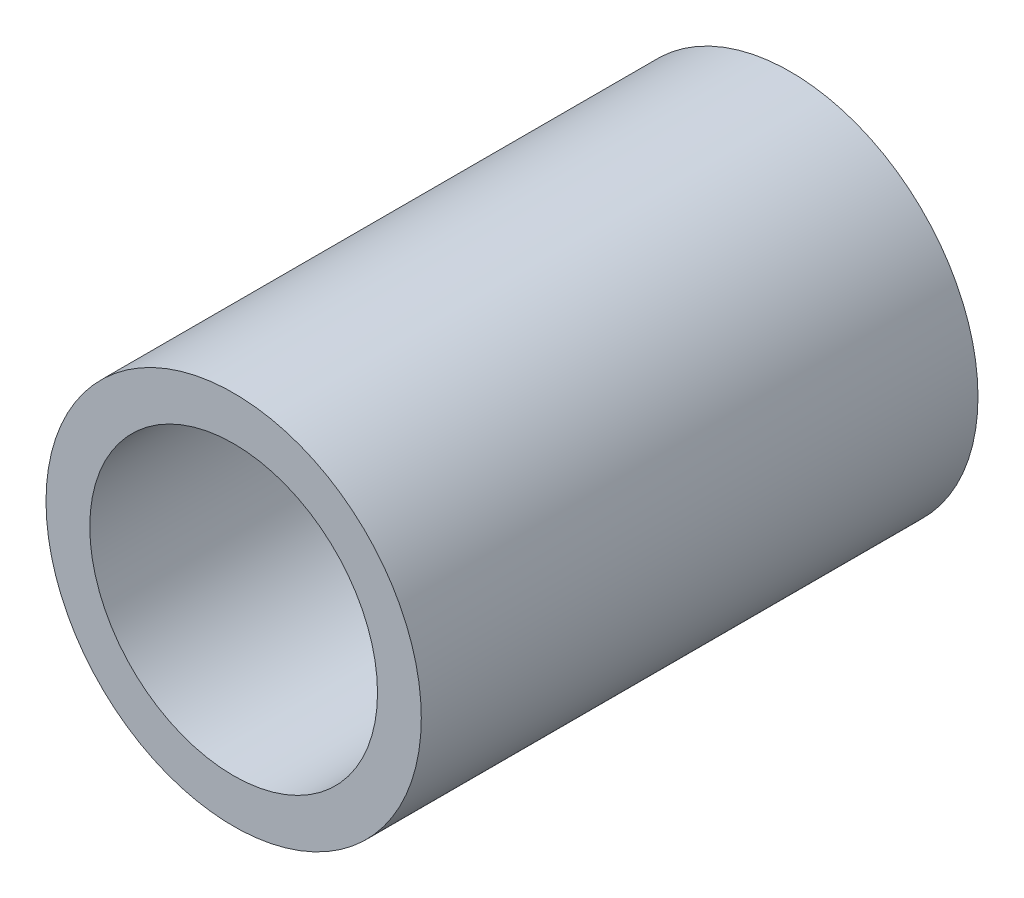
from build123d import *

# Parameters (mm, degrees)
ESQUISSE1_R      = 1.5
ESQUISSE1_R_2    = 1.15
EXTRUSION1_DEPTH = 4.45


with BuildPart() as part:
    # Esquisse1 → Extrusion1 (new body)
    with BuildSketch(Plane.XY):
        Circle(ESQUISSE1_R)
        Circle(ESQUISSE1_R_2, mode=Mode.SUBTRACT)
    extrude(amount=EXTRUSION1_DEPTH)


solid = part.part
